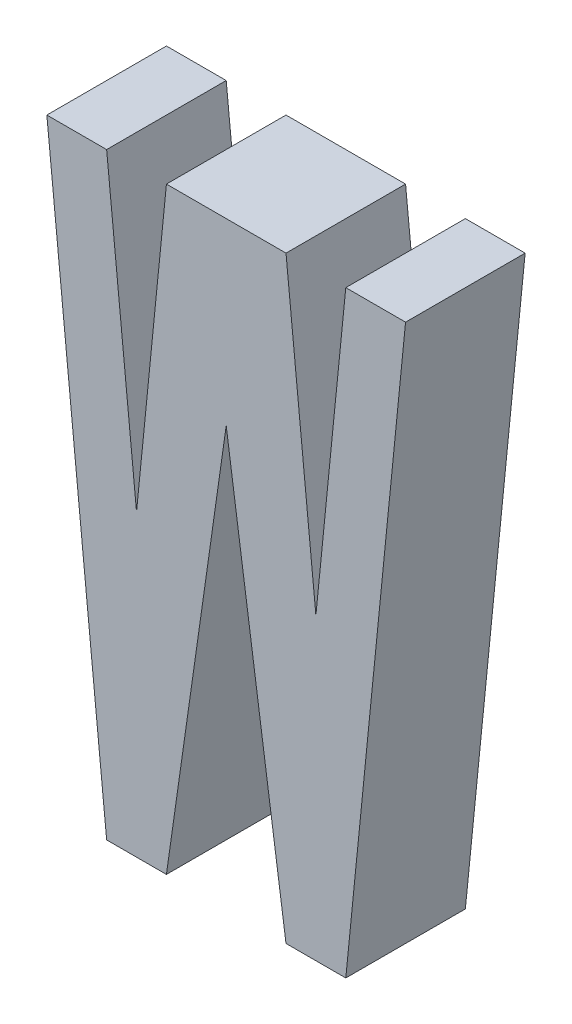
ISO-10303-21;
HEADER;
FILE_DESCRIPTION(('STEP AP214'),'2;1');
FILE_NAME('part.step','',(''),(''),'','','');
FILE_SCHEMA(('AUTOMOTIVE_DESIGN { 1 0 10303 214 1 1 1 1 }'));
ENDSEC;
DATA;
#1=APPLICATION_CONTEXT('core data for automotive mechanical design processes');
#2=APPLICATION_PROTOCOL_DEFINITION('international standard','automotive_design',2000,#1);
#3=PRODUCT_CONTEXT('',#1,'mechanical');
#4=PRODUCT('Part','Part','',(#3));
#5=PRODUCT_RELATED_PRODUCT_CATEGORY('part','',(#4));
#6=PRODUCT_DEFINITION_FORMATION('','',#4);
#7=PRODUCT_DEFINITION_CONTEXT('part definition',#1,'design');
#8=PRODUCT_DEFINITION('design','',#6,#7);
#9=PRODUCT_DEFINITION_SHAPE('','',#8);
#10=(LENGTH_UNIT() NAMED_UNIT(*) SI_UNIT(.MILLI.,.METRE.));
#11=(NAMED_UNIT(*) PLANE_ANGLE_UNIT() SI_UNIT($,.RADIAN.));
#12=(NAMED_UNIT(*) SI_UNIT($,.STERADIAN.) SOLID_ANGLE_UNIT());
#13=UNCERTAINTY_MEASURE_WITH_UNIT(LENGTH_MEASURE(1.E-05),#10,'distance_accuracy_value','');
#14=(GEOMETRIC_REPRESENTATION_CONTEXT(3) GLOBAL_UNCERTAINTY_ASSIGNED_CONTEXT((#13)) GLOBAL_UNIT_ASSIGNED_CONTEXT((#10,
#11,#12)) REPRESENTATION_CONTEXT('',''));
#15=CARTESIAN_POINT('',(0.,0.,0.));
#16=DIRECTION('',(0.,0.,1.));
#17=DIRECTION('',(1.,0.,0.));
#18=AXIS2_PLACEMENT_3D('',#15,#16,#17);
#19=CARTESIAN_POINT('',(25.,50.,10.));
#20=DIRECTION('',(0.,-1.,0.));
#21=DIRECTION('',(0.,0.,-1.));
#22=AXIS2_PLACEMENT_3D('',#19,#20,#21);
#23=PLANE('',#22);
#24=DIRECTION('',(-1.,0.,0.));
#25=VECTOR('',#24,1.);
#26=CARTESIAN_POINT('',(25.,50.,0.));
#27=LINE('',#26,#25);
#28=CARTESIAN_POINT('',(30.,50.,0.));
#29=VERTEX_POINT('',#28);
#30=CARTESIAN_POINT('',(25.,50.,0.));
#31=VERTEX_POINT('',#30);
#32=EDGE_CURVE('E159',#29,#31,#27,.T.);
#33=ORIENTED_EDGE('',*,*,#32,.T.);
#34=DIRECTION('',(0.,0.,-1.));
#35=VECTOR('',#34,1.);
#36=CARTESIAN_POINT('',(25.,50.,10.));
#37=LINE('',#36,#35);
#38=CARTESIAN_POINT('',(25.,50.,10.));
#39=VERTEX_POINT('',#38);
#40=EDGE_CURVE('E11',#39,#31,#37,.T.);
#41=ORIENTED_EDGE('',*,*,#40,.F.);
#42=DIRECTION('',(-1.,0.,0.));
#43=VECTOR('',#42,1.);
#44=CARTESIAN_POINT('',(25.,50.,10.));
#45=LINE('',#44,#43);
#46=CARTESIAN_POINT('',(30.,50.,10.));
#47=VERTEX_POINT('',#46);
#48=EDGE_CURVE('E183',#47,#39,#45,.T.);
#49=ORIENTED_EDGE('',*,*,#48,.F.);
#50=DIRECTION('',(0.,0.,-1.));
#51=VECTOR('',#50,1.);
#52=CARTESIAN_POINT('',(30.,50.,10.));
#53=LINE('',#52,#51);
#54=EDGE_CURVE('E155',#47,#29,#53,.T.);
#55=ORIENTED_EDGE('',*,*,#54,.T.);
#56=EDGE_LOOP('',(#33,#41,#49,#55));
#57=FACE_BOUND('',#56,.T.);
#58=ADVANCED_FACE('F33',(#57),#23,.F.);
#59=CARTESIAN_POINT('',(25.,50.,10.));
#60=DIRECTION('',(0.995037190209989,-0.0995037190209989,0.));
#61=DIRECTION('',(0.0995037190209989,0.995037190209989,0.));
#62=AXIS2_PLACEMENT_3D('',#59,#60,#61);
#63=PLANE('',#62);
#64=DIRECTION('',(-0.0995037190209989,-0.995037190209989,0.));
#65=VECTOR('',#64,1.);
#66=CARTESIAN_POINT('',(25.,50.,0.));
#67=LINE('',#66,#65);
#68=CARTESIAN_POINT('',(22.5,25.,0.));
#69=VERTEX_POINT('',#68);
#70=EDGE_CURVE('E162',#31,#69,#67,.T.);
#71=ORIENTED_EDGE('',*,*,#70,.T.);
#72=DIRECTION('',(0.,0.,-1.));
#73=VECTOR('',#72,1.);
#74=CARTESIAN_POINT('',(22.5,25.,10.));
#75=LINE('',#74,#73);
#76=CARTESIAN_POINT('',(22.5,25.,10.));
#77=VERTEX_POINT('',#76);
#78=EDGE_CURVE('E41',#77,#69,#75,.T.);
#79=ORIENTED_EDGE('',*,*,#78,.F.);
#80=DIRECTION('',(-0.0995037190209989,-0.995037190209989,0.));
#81=VECTOR('',#80,1.);
#82=CARTESIAN_POINT('',(25.,50.,10.));
#83=LINE('',#82,#81);
#84=EDGE_CURVE('E107',#39,#77,#83,.T.);
#85=ORIENTED_EDGE('',*,*,#84,.F.);
#86=ORIENTED_EDGE('',*,*,#40,.T.);
#87=EDGE_LOOP('',(#71,#79,#85,#86));
#88=FACE_BOUND('',#87,.T.);
#89=ADVANCED_FACE('F266',(#88),#63,.F.);
#90=CARTESIAN_POINT('',(22.5,25.,10.));
#91=DIRECTION('',(-0.995037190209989,-0.099503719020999,0.));
#92=DIRECTION('',(0.099503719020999,-0.995037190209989,0.));
#93=AXIS2_PLACEMENT_3D('',#90,#91,#92);
#94=PLANE('',#93);
#95=DIRECTION('',(-0.099503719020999,0.995037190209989,0.));
#96=VECTOR('',#95,1.);
#97=CARTESIAN_POINT('',(22.5,25.,0.));
#98=LINE('',#97,#96);
#99=CARTESIAN_POINT('',(20.,50.,0.));
#100=VERTEX_POINT('',#99);
#101=EDGE_CURVE('E164',#69,#100,#98,.T.);
#102=ORIENTED_EDGE('',*,*,#101,.T.);
#103=DIRECTION('',(0.,0.,-1.));
#104=VECTOR('',#103,1.);
#105=CARTESIAN_POINT('',(20.,50.,10.));
#106=LINE('',#105,#104);
#107=CARTESIAN_POINT('',(20.,50.,10.));
#108=VERTEX_POINT('',#107);
#109=EDGE_CURVE('E205',#108,#100,#106,.T.);
#110=ORIENTED_EDGE('',*,*,#109,.F.);
#111=DIRECTION('',(-0.099503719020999,0.995037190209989,0.));
#112=VECTOR('',#111,1.);
#113=CARTESIAN_POINT('',(22.5,25.,10.));
#114=LINE('',#113,#112);
#115=EDGE_CURVE('E213',#77,#108,#114,.T.);
#116=ORIENTED_EDGE('',*,*,#115,.F.);
#117=ORIENTED_EDGE('',*,*,#78,.T.);
#118=EDGE_LOOP('',(#102,#110,#116,#117));
#119=FACE_BOUND('',#118,.T.);
#120=ADVANCED_FACE('F211',(#119),#94,.F.);
#121=CARTESIAN_POINT('',(10.,50.,10.));
#122=DIRECTION('',(0.,-1.,0.));
#123=DIRECTION('',(0.,0.,-1.));
#124=AXIS2_PLACEMENT_3D('',#121,#122,#123);
#125=PLANE('',#124);
#126=DIRECTION('',(-1.,0.,0.));
#127=VECTOR('',#126,1.);
#128=CARTESIAN_POINT('',(10.,50.,0.));
#129=LINE('',#128,#127);
#130=CARTESIAN_POINT('',(10.,50.,0.));
#131=VERTEX_POINT('',#130);
#132=EDGE_CURVE('E166',#100,#131,#129,.T.);
#133=ORIENTED_EDGE('',*,*,#132,.T.);
#134=DIRECTION('',(0.,0.,-1.));
#135=VECTOR('',#134,1.);
#136=CARTESIAN_POINT('',(10.,50.,10.));
#137=LINE('',#136,#135);
#138=CARTESIAN_POINT('',(10.,50.,10.));
#139=VERTEX_POINT('',#138);
#140=EDGE_CURVE('E202',#139,#131,#137,.T.);
#141=ORIENTED_EDGE('',*,*,#140,.F.);
#142=DIRECTION('',(-1.,0.,0.));
#143=VECTOR('',#142,1.);
#144=CARTESIAN_POINT('',(10.,50.,10.));
#145=LINE('',#144,#143);
#146=EDGE_CURVE('E231',#108,#139,#145,.T.);
#147=ORIENTED_EDGE('',*,*,#146,.F.);
#148=ORIENTED_EDGE('',*,*,#109,.T.);
#149=EDGE_LOOP('',(#133,#141,#147,#148));
#150=FACE_BOUND('',#149,.T.);
#151=ADVANCED_FACE('F222',(#150),#125,.F.);
#152=CARTESIAN_POINT('',(10.,50.,10.));
#153=DIRECTION('',(0.995037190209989,-0.0995037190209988,0.));
#154=DIRECTION('',(0.0995037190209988,0.995037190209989,0.));
#155=AXIS2_PLACEMENT_3D('',#152,#153,#154);
#156=PLANE('',#155);
#157=DIRECTION('',(-0.0995037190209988,-0.995037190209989,0.));
#158=VECTOR('',#157,1.);
#159=CARTESIAN_POINT('',(10.,50.,0.));
#160=LINE('',#159,#158);
#161=CARTESIAN_POINT('',(7.5,25.,0.));
#162=VERTEX_POINT('',#161);
#163=EDGE_CURVE('E168',#131,#162,#160,.T.);
#164=ORIENTED_EDGE('',*,*,#163,.T.);
#165=DIRECTION('',(0.,0.,-1.));
#166=VECTOR('',#165,1.);
#167=CARTESIAN_POINT('',(7.5,25.,10.));
#168=LINE('',#167,#166);
#169=CARTESIAN_POINT('',(7.5,25.,10.));
#170=VERTEX_POINT('',#169);
#171=EDGE_CURVE('E199',#170,#162,#168,.T.);
#172=ORIENTED_EDGE('',*,*,#171,.F.);
#173=DIRECTION('',(-0.0995037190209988,-0.995037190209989,0.));
#174=VECTOR('',#173,1.);
#175=CARTESIAN_POINT('',(10.,50.,10.));
#176=LINE('',#175,#174);
#177=EDGE_CURVE('E228',#139,#170,#176,.T.);
#178=ORIENTED_EDGE('',*,*,#177,.F.);
#179=ORIENTED_EDGE('',*,*,#140,.T.);
#180=EDGE_LOOP('',(#164,#172,#178,#179));
#181=FACE_BOUND('',#180,.T.);
#182=ADVANCED_FACE('F226',(#181),#156,.F.);
#183=CARTESIAN_POINT('',(7.5,25.,10.));
#184=DIRECTION('',(-0.995037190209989,-0.099503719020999,0.));
#185=DIRECTION('',(0.0995037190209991,-0.995037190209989,0.));
#186=AXIS2_PLACEMENT_3D('',#183,#184,#185);
#187=PLANE('',#186);
#188=DIRECTION('',(-0.099503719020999,0.995037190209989,0.));
#189=VECTOR('',#188,1.);
#190=CARTESIAN_POINT('',(7.5,25.,0.));
#191=LINE('',#190,#189);
#192=CARTESIAN_POINT('',(5.,50.,0.));
#193=VERTEX_POINT('',#192);
#194=EDGE_CURVE('E170',#162,#193,#191,.T.);
#195=ORIENTED_EDGE('',*,*,#194,.T.);
#196=DIRECTION('',(0.,0.,-1.));
#197=VECTOR('',#196,1.);
#198=CARTESIAN_POINT('',(5.,50.,10.));
#199=LINE('',#198,#197);
#200=CARTESIAN_POINT('',(5.,50.,10.));
#201=VERTEX_POINT('',#200);
#202=EDGE_CURVE('E196',#201,#193,#199,.T.);
#203=ORIENTED_EDGE('',*,*,#202,.F.);
#204=DIRECTION('',(-0.099503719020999,0.995037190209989,0.));
#205=VECTOR('',#204,1.);
#206=CARTESIAN_POINT('',(7.5,25.,10.));
#207=LINE('',#206,#205);
#208=EDGE_CURVE('E230',#170,#201,#207,.T.);
#209=ORIENTED_EDGE('',*,*,#208,.F.);
#210=ORIENTED_EDGE('',*,*,#171,.T.);
#211=EDGE_LOOP('',(#195,#203,#209,#210));
#212=FACE_BOUND('',#211,.T.);
#213=ADVANCED_FACE('F279',(#212),#187,.F.);
#214=CARTESIAN_POINT('',(0.,50.,10.));
#215=DIRECTION('',(0.,-1.,0.));
#216=DIRECTION('',(0.,0.,-1.));
#217=AXIS2_PLACEMENT_3D('',#214,#215,#216);
#218=PLANE('',#217);
#219=DIRECTION('',(-1.,0.,0.));
#220=VECTOR('',#219,1.);
#221=CARTESIAN_POINT('',(0.,50.,0.));
#222=LINE('',#221,#220);
#223=CARTESIAN_POINT('',(0.,50.,0.));
#224=VERTEX_POINT('',#223);
#225=EDGE_CURVE('E172',#193,#224,#222,.T.);
#226=ORIENTED_EDGE('',*,*,#225,.T.);
#227=DIRECTION('',(0.,0.,-1.));
#228=VECTOR('',#227,1.);
#229=CARTESIAN_POINT('',(0.,50.,10.));
#230=LINE('',#229,#228);
#231=CARTESIAN_POINT('',(0.,50.,10.));
#232=VERTEX_POINT('',#231);
#233=EDGE_CURVE('E193',#232,#224,#230,.T.);
#234=ORIENTED_EDGE('',*,*,#233,.F.);
#235=DIRECTION('',(-1.,0.,0.));
#236=VECTOR('',#235,1.);
#237=CARTESIAN_POINT('',(0.,50.,10.));
#238=LINE('',#237,#236);
#239=EDGE_CURVE('E233',#201,#232,#238,.T.);
#240=ORIENTED_EDGE('',*,*,#239,.F.);
#241=ORIENTED_EDGE('',*,*,#202,.T.);
#242=EDGE_LOOP('',(#226,#234,#240,#241));
#243=FACE_BOUND('',#242,.T.);
#244=ADVANCED_FACE('F282',(#243),#218,.F.);
#245=CARTESIAN_POINT('',(0.,50.,10.));
#246=DIRECTION('',(0.995037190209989,0.0995037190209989,0.));
#247=DIRECTION('',(-0.0995037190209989,0.995037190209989,0.));
#248=AXIS2_PLACEMENT_3D('',#245,#246,#247);
#249=PLANE('',#248);
#250=DIRECTION('',(0.0995037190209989,-0.995037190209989,0.));
#251=VECTOR('',#250,1.);
#252=CARTESIAN_POINT('',(0.,50.,0.));
#253=LINE('',#252,#251);
#254=CARTESIAN_POINT('',(5.,0.,0.));
#255=VERTEX_POINT('',#254);
#256=EDGE_CURVE('E174',#224,#255,#253,.T.);
#257=ORIENTED_EDGE('',*,*,#256,.T.);
#258=DIRECTION('',(0.,0.,-1.));
#259=VECTOR('',#258,1.);
#260=CARTESIAN_POINT('',(5.,0.,10.));
#261=LINE('',#260,#259);
#262=CARTESIAN_POINT('',(5.,0.,10.));
#263=VERTEX_POINT('',#262);
#264=EDGE_CURVE('E190',#263,#255,#261,.T.);
#265=ORIENTED_EDGE('',*,*,#264,.F.);
#266=DIRECTION('',(0.0995037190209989,-0.995037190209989,0.));
#267=VECTOR('',#266,1.);
#268=CARTESIAN_POINT('',(0.,50.,10.));
#269=LINE('',#268,#267);
#270=EDGE_CURVE('E239',#232,#263,#269,.T.);
#271=ORIENTED_EDGE('',*,*,#270,.F.);
#272=ORIENTED_EDGE('',*,*,#233,.T.);
#273=EDGE_LOOP('',(#257,#265,#271,#272));
#274=FACE_BOUND('',#273,.T.);
#275=ADVANCED_FACE('F286',(#274),#249,.F.);
#276=CARTESIAN_POINT('',(5.,0.,10.));
#277=DIRECTION('',(0.,1.,0.));
#278=DIRECTION('',(0.,0.,1.));
#279=AXIS2_PLACEMENT_3D('',#276,#277,#278);
#280=PLANE('',#279);
#281=DIRECTION('',(1.,0.,0.));
#282=VECTOR('',#281,1.);
#283=CARTESIAN_POINT('',(5.,0.,0.));
#284=LINE('',#283,#282);
#285=CARTESIAN_POINT('',(10.,0.,0.));
#286=VERTEX_POINT('',#285);
#287=EDGE_CURVE('E176',#255,#286,#284,.T.);
#288=ORIENTED_EDGE('',*,*,#287,.T.);
#289=DIRECTION('',(0.,0.,-1.));
#290=VECTOR('',#289,1.);
#291=CARTESIAN_POINT('',(10.,0.,10.));
#292=LINE('',#291,#290);
#293=CARTESIAN_POINT('',(10.,0.,10.));
#294=VERTEX_POINT('',#293);
#295=EDGE_CURVE('E187',#294,#286,#292,.T.);
#296=ORIENTED_EDGE('',*,*,#295,.F.);
#297=DIRECTION('',(1.,0.,0.));
#298=VECTOR('',#297,1.);
#299=CARTESIAN_POINT('',(5.,0.,10.));
#300=LINE('',#299,#298);
#301=EDGE_CURVE('E241',#263,#294,#300,.T.);
#302=ORIENTED_EDGE('',*,*,#301,.F.);
#303=ORIENTED_EDGE('',*,*,#264,.T.);
#304=EDGE_LOOP('',(#288,#296,#302,#303));
#305=FACE_BOUND('',#304,.T.);
#306=ADVANCED_FACE('F247',(#305),#280,.F.);
#307=CARTESIAN_POINT('',(10.,0.,10.));
#308=DIRECTION('',(-0.989949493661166,0.141421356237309,0.));
#309=DIRECTION('',(-0.141421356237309,-0.989949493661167,0.));
#310=AXIS2_PLACEMENT_3D('',#307,#308,#309);
#311=PLANE('',#310);
#312=DIRECTION('',(0.141421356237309,0.989949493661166,0.));
#313=VECTOR('',#312,1.);
#314=CARTESIAN_POINT('',(10.,0.,0.));
#315=LINE('',#314,#313);
#316=CARTESIAN_POINT('',(15.,35.,0.));
#317=VERTEX_POINT('',#316);
#318=EDGE_CURVE('E178',#286,#317,#315,.T.);
#319=ORIENTED_EDGE('',*,*,#318,.T.);
#320=DIRECTION('',(0.,0.,-1.));
#321=VECTOR('',#320,1.);
#322=CARTESIAN_POINT('',(15.,35.,10.));
#323=LINE('',#322,#321);
#324=CARTESIAN_POINT('',(15.,35.,10.));
#325=VERTEX_POINT('',#324);
#326=EDGE_CURVE('E150',#325,#317,#323,.T.);
#327=ORIENTED_EDGE('',*,*,#326,.F.);
#328=DIRECTION('',(0.141421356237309,0.989949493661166,0.));
#329=VECTOR('',#328,1.);
#330=CARTESIAN_POINT('',(10.,0.,10.));
#331=LINE('',#330,#329);
#332=EDGE_CURVE('E141',#294,#325,#331,.T.);
#333=ORIENTED_EDGE('',*,*,#332,.F.);
#334=ORIENTED_EDGE('',*,*,#295,.T.);
#335=EDGE_LOOP('',(#319,#327,#333,#334));
#336=FACE_BOUND('',#335,.T.);
#337=ADVANCED_FACE('F251',(#336),#311,.F.);
#338=CARTESIAN_POINT('',(15.,35.,10.));
#339=DIRECTION('',(0.989949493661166,0.141421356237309,0.));
#340=DIRECTION('',(-0.141421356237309,0.989949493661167,0.));
#341=AXIS2_PLACEMENT_3D('',#338,#339,#340);
#342=PLANE('',#341);
#343=DIRECTION('',(0.141421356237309,-0.989949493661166,0.));
#344=VECTOR('',#343,1.);
#345=CARTESIAN_POINT('',(15.,35.,0.));
#346=LINE('',#345,#344);
#347=CARTESIAN_POINT('',(20.,0.,0.));
#348=VERTEX_POINT('',#347);
#349=EDGE_CURVE('E149',#317,#348,#346,.T.);
#350=ORIENTED_EDGE('',*,*,#349,.T.);
#351=DIRECTION('',(0.,0.,-1.));
#352=VECTOR('',#351,1.);
#353=CARTESIAN_POINT('',(20.,0.,10.));
#354=LINE('',#353,#352);
#355=CARTESIAN_POINT('',(20.,0.,10.));
#356=VERTEX_POINT('',#355);
#357=EDGE_CURVE('E146',#356,#348,#354,.T.);
#358=ORIENTED_EDGE('',*,*,#357,.F.);
#359=DIRECTION('',(0.141421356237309,-0.989949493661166,0.));
#360=VECTOR('',#359,1.);
#361=CARTESIAN_POINT('',(15.,35.,10.));
#362=LINE('',#361,#360);
#363=EDGE_CURVE('E135',#325,#356,#362,.T.);
#364=ORIENTED_EDGE('',*,*,#363,.F.);
#365=ORIENTED_EDGE('',*,*,#326,.T.);
#366=EDGE_LOOP('',(#350,#358,#364,#365));
#367=FACE_BOUND('',#366,.T.);
#368=ADVANCED_FACE('F147',(#367),#342,.F.);
#369=CARTESIAN_POINT('',(20.,0.,10.));
#370=DIRECTION('',(0.,1.,0.));
#371=DIRECTION('',(0.,0.,1.));
#372=AXIS2_PLACEMENT_3D('',#369,#370,#371);
#373=PLANE('',#372);
#374=DIRECTION('',(1.,0.,0.));
#375=VECTOR('',#374,1.);
#376=CARTESIAN_POINT('',(20.,0.,0.));
#377=LINE('',#376,#375);
#378=CARTESIAN_POINT('',(25.,0.,0.));
#379=VERTEX_POINT('',#378);
#380=EDGE_CURVE('E93',#348,#379,#377,.T.);
#381=ORIENTED_EDGE('',*,*,#380,.T.);
#382=DIRECTION('',(0.,0.,-1.));
#383=VECTOR('',#382,1.);
#384=CARTESIAN_POINT('',(25.,0.,10.));
#385=LINE('',#384,#383);
#386=CARTESIAN_POINT('',(25.,0.,10.));
#387=VERTEX_POINT('',#386);
#388=EDGE_CURVE('E151',#387,#379,#385,.T.);
#389=ORIENTED_EDGE('',*,*,#388,.F.);
#390=DIRECTION('',(1.,0.,0.));
#391=VECTOR('',#390,1.);
#392=CARTESIAN_POINT('',(20.,0.,10.));
#393=LINE('',#392,#391);
#394=EDGE_CURVE('E139',#356,#387,#393,.T.);
#395=ORIENTED_EDGE('',*,*,#394,.F.);
#396=ORIENTED_EDGE('',*,*,#357,.T.);
#397=EDGE_LOOP('',(#381,#389,#395,#396));
#398=FACE_BOUND('',#397,.T.);
#399=ADVANCED_FACE('F153',(#398),#373,.F.);
#400=CARTESIAN_POINT('',(25.,0.,10.));
#401=DIRECTION('',(-0.995037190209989,0.0995037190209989,0.));
#402=DIRECTION('',(-0.099503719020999,-0.995037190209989,0.));
#403=AXIS2_PLACEMENT_3D('',#400,#401,#402);
#404=PLANE('',#403);
#405=DIRECTION('',(0.0995037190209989,0.995037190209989,0.));
#406=VECTOR('',#405,1.);
#407=CARTESIAN_POINT('',(25.,0.,0.));
#408=LINE('',#407,#406);
#409=EDGE_CURVE('E99',#379,#29,#408,.T.);
#410=ORIENTED_EDGE('',*,*,#409,.T.);
#411=ORIENTED_EDGE('',*,*,#54,.F.);
#412=DIRECTION('',(0.0995037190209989,0.995037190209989,0.));
#413=VECTOR('',#412,1.);
#414=CARTESIAN_POINT('',(25.,0.,10.));
#415=LINE('',#414,#413);
#416=EDGE_CURVE('E49',#387,#47,#415,.T.);
#417=ORIENTED_EDGE('',*,*,#416,.F.);
#418=ORIENTED_EDGE('',*,*,#388,.T.);
#419=EDGE_LOOP('',(#410,#411,#417,#418));
#420=FACE_BOUND('',#419,.T.);
#421=ADVANCED_FACE('F255',(#420),#404,.F.);
#422=CARTESIAN_POINT('',(0.,0.,10.));
#423=DIRECTION('',(0.,0.,1.));
#424=DIRECTION('',(1.,0.,0.));
#425=AXIS2_PLACEMENT_3D('',#422,#423,#424);
#426=PLANE('',#425);
#427=ORIENTED_EDGE('',*,*,#48,.T.);
#428=ORIENTED_EDGE('',*,*,#84,.T.);
#429=ORIENTED_EDGE('',*,*,#115,.T.);
#430=ORIENTED_EDGE('',*,*,#146,.T.);
#431=ORIENTED_EDGE('',*,*,#177,.T.);
#432=ORIENTED_EDGE('',*,*,#208,.T.);
#433=ORIENTED_EDGE('',*,*,#239,.T.);
#434=ORIENTED_EDGE('',*,*,#270,.T.);
#435=ORIENTED_EDGE('',*,*,#301,.T.);
#436=ORIENTED_EDGE('',*,*,#332,.T.);
#437=ORIENTED_EDGE('',*,*,#363,.T.);
#438=ORIENTED_EDGE('',*,*,#394,.T.);
#439=ORIENTED_EDGE('',*,*,#416,.T.);
#440=EDGE_LOOP('',(#427,#428,#429,#430,#431,#432,#433,#434,#435,#436,#437,#438,#439));
#441=FACE_BOUND('',#440,.T.);
#442=ADVANCED_FACE('F137',(#441),#426,.T.);
#443=CARTESIAN_POINT('',(0.,0.,0.));
#444=DIRECTION('',(0.,0.,1.));
#445=DIRECTION('',(1.,0.,0.));
#446=AXIS2_PLACEMENT_3D('',#443,#444,#445);
#447=PLANE('',#446);
#448=ORIENTED_EDGE('',*,*,#32,.F.);
#449=ORIENTED_EDGE('',*,*,#409,.F.);
#450=ORIENTED_EDGE('',*,*,#380,.F.);
#451=ORIENTED_EDGE('',*,*,#349,.F.);
#452=ORIENTED_EDGE('',*,*,#318,.F.);
#453=ORIENTED_EDGE('',*,*,#287,.F.);
#454=ORIENTED_EDGE('',*,*,#256,.F.);
#455=ORIENTED_EDGE('',*,*,#225,.F.);
#456=ORIENTED_EDGE('',*,*,#194,.F.);
#457=ORIENTED_EDGE('',*,*,#163,.F.);
#458=ORIENTED_EDGE('',*,*,#132,.F.);
#459=ORIENTED_EDGE('',*,*,#101,.F.);
#460=ORIENTED_EDGE('',*,*,#70,.F.);
#461=EDGE_LOOP('',(#448,#449,#450,#451,#452,#453,#454,#455,#456,#457,#458,#459,#460));
#462=FACE_BOUND('',#461,.T.);
#463=ADVANCED_FACE('F217',(#462),#447,.F.);
#464=CLOSED_SHELL('',(#58,#89,#120,#151,#182,#213,#244,#275,#306,#337,#368,#399,#421,#442,#463));
#465=MANIFOLD_SOLID_BREP('B2',#464);
#466=ADVANCED_BREP_SHAPE_REPRESENTATION('',(#18,#465),#14);
#467=SHAPE_DEFINITION_REPRESENTATION(#9,#466);
ENDSEC;
END-ISO-10303-21;
